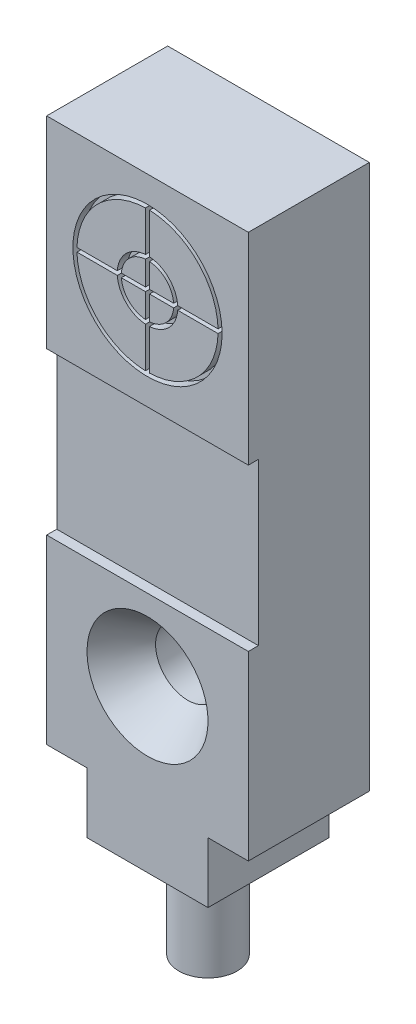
from build123d import *

# Parameters (mm, degrees)
SKETCH_1_W            = 10
SKETCH_1_H            = 27
EXTRUDE_1_DEPTH       = 6
SKETCH_2_W            = 10
SKETCH_2_H            = 8
CUT_EXTRUDE_1_DEPTH   = 0.5
SKETCH_3_R            = 1.6
CUT_EXTRUDE_2_DEPTH   = 6
CHAMFER_1_SIZE        = 1.4
CHAMFER_1_SIZE2       = 2
SKETCH_5_R            = 3.7
SKETCH_5_R_2          = 3.5
CUT_EXTRUDE_3_DEPTH   = 0.5
SKETCH_6_R            = 1.5
SKETCH_6_R_2          = 1.3
CUT_EXTRUDE_4_DEPTH   = 0.5
SKETCH_7_W            = 0.2
SKETCH_7_H            = 7
SKETCH_7_W_2          = 7
SKETCH_7_H_2          = 0.2
CUT_EXTRUDE_1_2_DEPTH = 0.5
SKETCH_8_W            = 6
SKETCH_8_H            = 6
EXTRUDE_2_DEPTH       = 3
SKETCH_9_R            = 1.45
EXTRUDE_3_DEPTH       = 5


with BuildPart() as part:
    # Sketch 1 → Extrude 1 (new body)
    with BuildSketch(Plane.XY):
        with Locations((5, 13.5)):
            Rectangle(SKETCH_1_W, SKETCH_1_H)
    extrude(amount=EXTRUDE_1_DEPTH)

    # Sketch 2 → Cut-Extrude 1 (cut)
    with BuildSketch(Plane.XY.offset(6)):
        with Locations((5, 13)):
            Rectangle(SKETCH_2_W, SKETCH_2_H)
    extrude(amount=-CUT_EXTRUDE_1_DEPTH, mode=Mode.SUBTRACT)

    # Sketch 3 → Cut-Extrude 2 (cut)
    with BuildSketch(Plane.XY.offset(6)):
        with Locations((5, 5)):
            Circle(SKETCH_3_R)
    extrude(amount=-CUT_EXTRUDE_2_DEPTH, mode=Mode.SUBTRACT)

    # Chamfer 1
    chamfer_1_edges = [part.edges().sort_by_distance(p)[0] for p in [
        (3.4, 5, 6),
    ]]
    chamfer_1_side = [part.faces().sort_by_distance(p)[0] for p in [
        (5, 0.13453624, 6),
    ]]
    chamfer(chamfer_1_edges, length=CHAMFER_1_SIZE, length2=CHAMFER_1_SIZE2, reference=chamfer_1_side[0])

    # Sketch 5 → Cut-Extrude 3 (cut)
    with BuildSketch(Plane.XY.offset(6)):
        with Locations((5, 22)):
            Circle(SKETCH_5_R)
        with Locations((5, 22)):
            Circle(SKETCH_5_R_2, mode=Mode.SUBTRACT)
    extrude(amount=-CUT_EXTRUDE_3_DEPTH, mode=Mode.SUBTRACT)

    # Sketch 6 → Cut-Extrude 4 (cut)
    with BuildSketch(Plane.XY.offset(6)):
        with Locations((5, 22)):
            Circle(SKETCH_6_R)
        with Locations((5, 22)):
            Circle(SKETCH_6_R_2, mode=Mode.SUBTRACT)
    extrude(amount=-CUT_EXTRUDE_4_DEPTH, mode=Mode.SUBTRACT)

    # Sketch 7 → Cut-Extrude 1 2 (cut)
    with BuildSketch(Plane.XY.offset(6)):
        with Locations((5, 22)):
            Rectangle(SKETCH_7_W, SKETCH_7_H)
        with Locations((5, 22)):
            Rectangle(SKETCH_7_W_2, SKETCH_7_H_2)
    extrude(amount=-CUT_EXTRUDE_1_2_DEPTH, mode=Mode.SUBTRACT)

    # Sketch 8 → Extrude 2 (add)
    with BuildSketch(Plane.XZ):
        with Locations((5, 3)):
            Rectangle(SKETCH_8_W, SKETCH_8_H)
    extrude(amount=EXTRUDE_2_DEPTH)

    # Sketch 9 → Extrude 3 (add)
    with BuildSketch(Plane.XZ.offset(3)):
        with Locations(Location((5, 3, 0), (0, 0, 90))):
            Circle(SKETCH_9_R)
    extrude(amount=EXTRUDE_3_DEPTH)


solid = part.part
